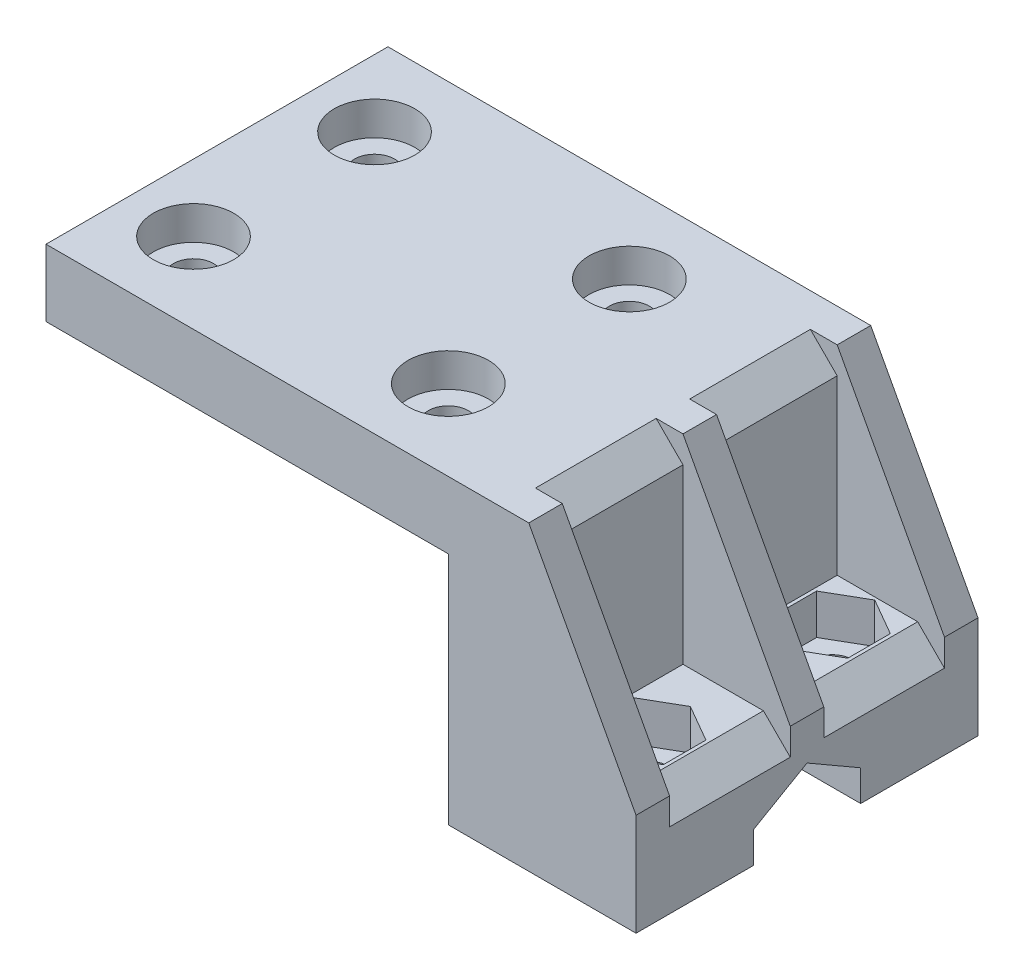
from build123d import *

# Parameters (mm, degrees)
BOSS_EXTRUDE1_DEPTH = 25.5
SKETCH3_R           = 1.5
CUT_EXTRUDE1_DEPTH  = 53.870546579
CUT_EXTRUDE2_DEPTH  = 3
SKETCH5_R           = 1.5
CUT_EXTRUDE3_DEPTH  = 53.870546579
SKETCH6_R           = 3
CUT_EXTRUDE4_DEPTH  = 2.5
BOSS_EXTRUDE2_DEPTH = 2.5
BOSS_EXTRUDE3_DEPTH = 1.25
CHAMFER1_SIZE       = 2
CUT_EXTRUDE5_START  = -4
SKETCH10_R          = 7.5
CUT_EXTRUDE5_DEPTH  = 4
CUT_EXTRUDE6_DEPTH  = 10


with BuildPart() as part:
    # Sketch2 → Boss-Extrude1 (new body)
    with BuildSketch(Plane.XY.offset(2.213619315)):
        Polygon((-5, 10), (-5, 5), (25, 5), (25, -12.5), (39, -12.5), (39, -4.881197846), (31, -4.881197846), (31, 10), align=None)
    extrude(amount=BOSS_EXTRUDE1_DEPTH)

    # Sketch3 → Cut-Extrude1 (cut, through all)
    with BuildSketch(Plane.XZ.offset(12.5)):
        with Locations(Location((34, 8.088619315, 0), (0, 0, 270))):
            Circle(SKETCH3_R)
        with Locations(Location((34, 21.838619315, 0), (0, 0, 270))):
            Circle(SKETCH3_R)
    extrude(amount=-CUT_EXTRUDE1_DEPTH, mode=Mode.SUBTRACT)

    # Sketch4 → Cut-Extrude2 (cut)
    with BuildSketch(Plane(origin=(0, -4.881197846, 0), x_dir=(1, 0, 0), z_dir=(0, 1, 0))):
        Polygon((31.25, -6.500906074), (31.25, -9.676332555), (34, -11.264045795), (36.75, -9.676332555), (36.75, -6.500906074), (34, -4.913192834), align=None)
        Polygon((31.25, -20.250906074), (31.25, -23.426332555), (34, -25.014045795), (36.75, -23.426332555), (36.75, -20.250906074), (34, -18.663192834), align=None)
    extrude(amount=-CUT_EXTRUDE2_DEPTH, mode=Mode.SUBTRACT)

    # Sketch5 → Cut-Extrude3 (cut, through all)
    with BuildSketch(Plane(origin=(0, 10, 0), x_dir=(1, 0, 0), z_dir=(0, 1, 0))):
        with Locations(Location((19, -8.213619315, 0), (0, 0, 180))):
            Circle(SKETCH5_R)
        with Locations(Location((19, -21.713619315, 0), (0, 0, 180))):
            Circle(SKETCH5_R)
        with Locations(Location((0, -21.713619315, 0), (0, 0, 180))):
            Circle(SKETCH5_R)
        with Locations(Location((0, -8.213619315, 0), (0, 0, 180))):
            Circle(SKETCH5_R)
    extrude(amount=-CUT_EXTRUDE3_DEPTH, mode=Mode.SUBTRACT)

    # Sketch6 → Cut-Extrude4 (cut)
    with BuildSketch(Plane(origin=(0, 10, 0), x_dir=(1, 0, 0), z_dir=(0, 1, 0))):
        with Locations(Location((0, -8.213619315, 0), (0, 0, 180))):
            Circle(SKETCH6_R)
        with Locations(Location((0, -21.713619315, 0), (0, 0, 180))):
            Circle(SKETCH6_R)
        with Locations(Location((19, -21.713619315, 0), (0, 0, 180))):
            Circle(SKETCH6_R)
        with Locations(Location((19, -8.213619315, 0), (0, 0, 180))):
            Circle(SKETCH6_R)
    extrude(amount=-CUT_EXTRUDE4_DEPTH, mode=Mode.SUBTRACT)

    # Sketch7 → Boss-Extrude2 (add)
    with BuildSketch(Plane.XY.offset(27.713619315)):
        Polygon((39, -4.881197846), (31, 10), (31, -4.881197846), align=None)
    boss_extrude2 = extrude(amount=-BOSS_EXTRUDE2_DEPTH)

    # Mirror1: Boss-Extrude2 across plane
    add(boss_extrude2.mirror(Plane(origin=(0, 0, 14.963619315), x_dir=(1, 0, 0), z_dir=(0, 0, -1))))

    # Sketch8 → Boss-Extrude3 (add, symmetric)
    with BuildSketch(Plane(origin=(0, 0, 14.963619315), x_dir=(-1, 0, 0), z_dir=(0, 0, -1))):
        Polygon((-31, 10), (-31, -4.881197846), (-39, -4.881197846), align=None)
    extrude(amount=BOSS_EXTRUDE3_DEPTH, both=True)

    # Chamfer1
    chamfer1_edges = [part.edges().sort_by_distance(p)[0] for p in [
        (31, 10, 20.713619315),
        (39, -4.881197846, 20.713619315),
        (31, 10, 9.213619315),
        (39, -4.881197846, 9.213619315),
    ]]
    chamfer(chamfer1_edges, length=CHAMFER1_SIZE)

    # Sketch10 → Cut-Extrude5 (cut)
    with BuildSketch(Plane.ZY.offset(-25).offset(CUT_EXTRUDE5_START)):
        with Locations((14.963619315, -12.5)):
            Circle(SKETCH10_R)
    extrude(amount=CUT_EXTRUDE5_DEPTH, mode=Mode.SUBTRACT)

    # Sketch11 → Cut-Extrude6 (cut)
    with BuildSketch(Plane(origin=(39, 0, 0), x_dir=(0, 0, -1), z_dir=(1, 0, 0))):
        Polygon((-14.963619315, -7.881197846), (-18.963619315, -10.190598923), (-18.963619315, -14.809401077), (-14.963619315, -17.118802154), (-10.963619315, -14.809401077), (-10.963619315, -10.190598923), align=None)
    extrude(amount=-CUT_EXTRUDE6_DEPTH, mode=Mode.SUBTRACT)


solid = part.part
